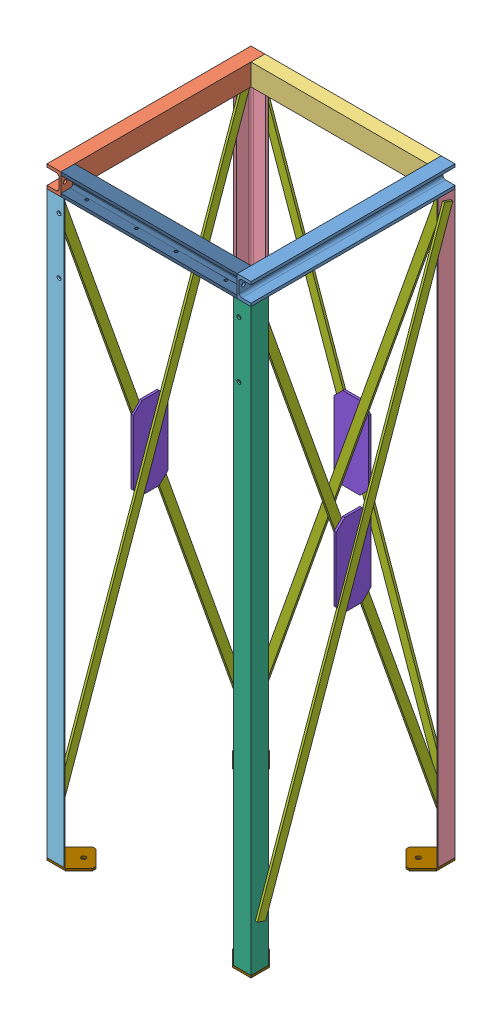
SolidWorks assembly Frame.SLDASM, configuration Initial (file format 15000). Lengths in mm.
Overall size (514.43 1395 514.43).
27 component instances, 12 part files, 3 mates.
Components (placement in the parent):
- Frame-basic-1: Frame-basic.SLDASM [Initial] at origin size (514.43 1395 514.43)
  - 3930-10449-4-01-1: 3930-10449-4-01.SLDPRT [Výchozí] at (220 0 0) size (32 50 472)
  - 3930-10450-4-01-1: 3930-10450-4-01.SLDPRT [Výchozí] at (-220 0 0) x (-1 0 0) z (0 0 -1) size (32 50 472)
  - 3930-10451-4-01-1: 3930-10451-4-01.SLDPRT [Výchozí] at (0 0 -220) x (0 0 -1) z (1 0 0) size (32 50 408)
  - 3930-10454-4-01-2: 3930-10454-4-01.SLDPRT [Výchozí] at (-216 -695 -216) x (1 0 0) z (0 -1 0) size (40 40 1340)
  - 3930-10454-4-01-1: 3930-10454-4-01.SLDPRT [Výchozí] at (216 -695 -216) x (0 0 1) z (0 -1 0) size (40 40 1340)
  - 3930-10455-4-01-1: 3930-10455-4-01.SLDPRT [Výchozí] at (-216 -695 216) x (1 0 0) z (0 1 0) size (40 40 1340)
  - 3930-10456-4-01-1: 3930-10456-4-01.SLDPRT [Výchozí] at (216 -695 216) x (0 0 -1) z (0 1 0) size (40 40 1340)
  - 3930-10459-4-01-4: 3930-10459-4-01.SLDPRT [Výchozí] at (-232 -651.1914 0) x (0 -0.333187 -0.942861) z (1 0 0) size (20 1300 5)
  - 3930-10459-4-01-1: 3930-10459-4-01.SLDPRT [Výchozí] at (-241 -651.1914 0) x (0 0.333187 -0.942861) z (1 0 0) size (20 1300 5)
  - Cross Gusset-1: Cross Gusset.SLDPRT [Výchozí] at (-232 -650 0) x (0 0 1) z (-1 0 0) size (80 190 5)
  - Feet-1: Feet.SLDPRT [Výchozí] at (-207.7157 -1370 207.7157) x (0.707107 0 -0.707107) z (0 1 0) size (80 60 5)
  - Feet-2: Feet.SLDPRT [Výchozí] at (207.7157 -1370 207.7157) x (-0.707107 0 -0.707107) z (0 1 0) size (80 60 5)
  - Feet-3: Feet.SLDPRT [Výchozí] at (207.7157 -1370 -207.7157) x (-0.707107 0 0.707107) z (0 1 0) size (80 60 5)
  - Feet-4: Feet.SLDPRT [Výchozí] at (-207.7157 -1370 -207.7157) x (0.707107 0 0.707107) z (0 1 0) size (80 60 5)
  - Cross Gusset-2: Cross Gusset.SLDPRT [Výchozí] at (0 -650 -232) x (-1 0 0) z (0 0 -1) size (80 190 5)
  - Cross Gusset-3: Cross Gusset.SLDPRT [Výchozí] at (232 -650 0) x (0 0 -1) z (1 0 0) size (80 190 5)
  - 3930-10459-4-01-5: 3930-10459-4-01.SLDPRT [Výchozí] at (0 -651.1914 -232) x (0.942861 -0.333187 0) z (0 0 1) size (20 1300 5)
  - 3930-10459-4-01-6: 3930-10459-4-01.SLDPRT [Výchozí] at (232 -651.1914 0) x (0 -0.333187 0.942861) z (-1 0 0) size (20 1300 5)
  - 3930-10459-4-01-2: 3930-10459-4-01.SLDPRT [Výchozí] at (0 -651.1914 -241) x (0.942861 0.333187 0) z (0 0 1) size (20 1300 5)
  - 3930-10459-4-01-3: 3930-10459-4-01.SLDPRT [Výchozí] at (241 -651.1914 0) x (0 0.333187 0.942861) z (-1 0 0) size (20 1300 5)
  - 3930-10108-4-01-1: 3930-10108-4-01.SLDPRT [Výchozí] at (-207 -25 217.5) x (0 0 1) z (0 -1 0) (suppressed, hidden)
  - 3930-10108-4-01-2: 3930-10108-4-01.SLDPRT [Výchozí] at (207 -25 217.5) x (0 0 1) z (0 -1 0) (suppressed, hidden)
- Beam-1: Beam.SLDASM [Initial] at (0 0 220) x (0 0 1) z (-1 0 0) size (32 50 408)
  - 3930-10452-4-01-1: 3930-10452-4-01.SLDPRT [Výchozí] at origin size (32 50 408)
  - 3930-10104-4-01-1: 3930-10104-4-01.SLDPRT [Výchozí] at (2.5 0 199) (suppressed, hidden)
  - 3930-10104-4-01-2: 3930-10104-4-01.SLDPRT [Výchozí] at (2.5 0 -204) (suppressed, hidden)
Mates (geometry in assembly coordinates):
- Sjednocený1: coincident aligned: plane of Frame-basic-1/3930-10450-4-01-1 through (-204 25 -236) normal (0 1 0); plane of Beam-1/3930-10452-4-01-1 through (-204 25 204) normal (0 1 0)
- Sjednocený2: coincident anti-aligned: plane of Frame-basic-1/3930-10450-4-01-1 through (-204 25 -236) normal (1 0 0); plane of Beam-1/3930-10452-4-01-1 through (-204 12.2 214.4) normal (-1 0 0)
- Sjednocený3: coincident aligned: plane of Frame-basic-1/3930-10450-4-01-1 through (-214.4 12.2 236) normal (0 0 1); plane of Beam-1/3930-10452-4-01-1 through (-204 25 236) normal (0 0 1)
